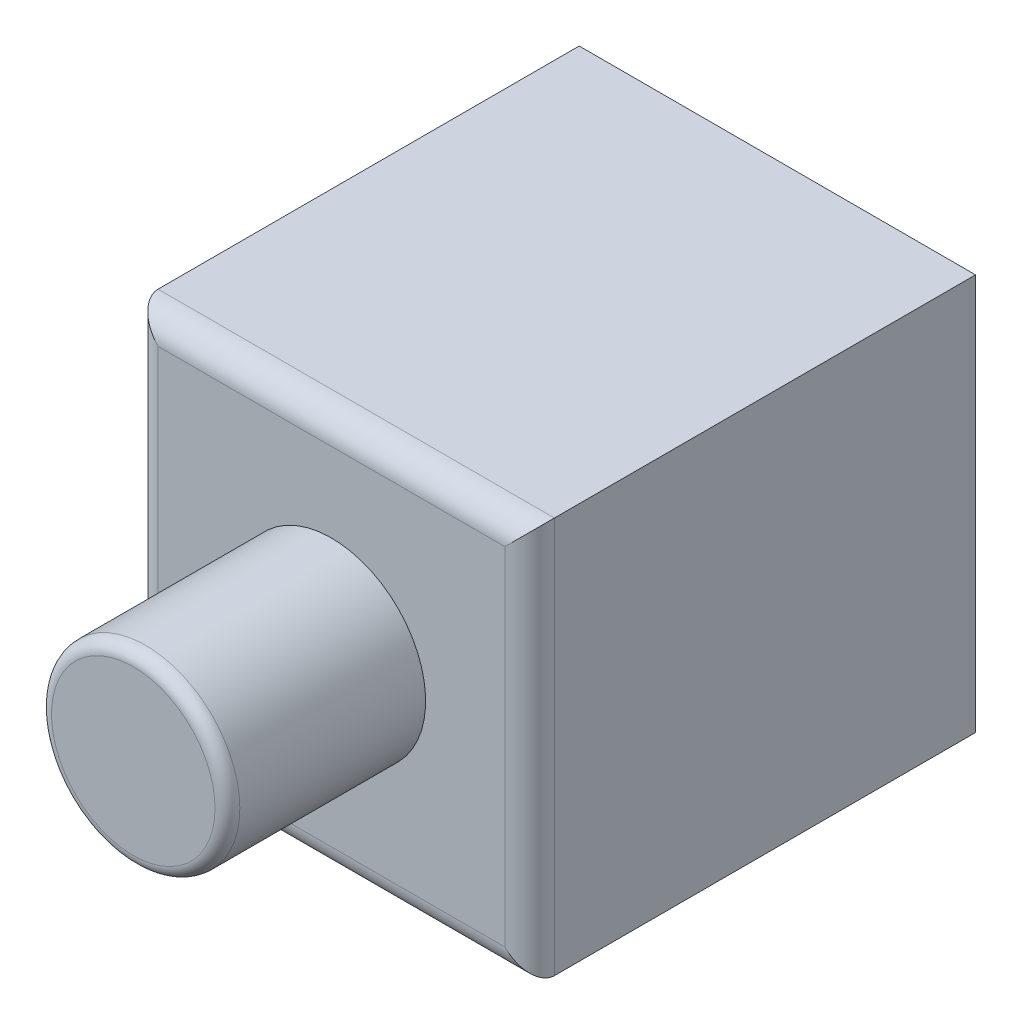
from build123d import *

# Parameters (mm, degrees)
SKETCH1_W      = 8
SKETCH1_H      = 8
EXTRUDE1_DEPTH = 9
SKETCH2_R      = 1.9
EXTRUDE2_DEPTH = 13
FILLET1_R      = 0.25
FILLET2_R      = 0.5


with BuildPart() as part:
    # Sketch1 → Extrude1 (new body)
    with BuildSketch(Plane.XY):
        Rectangle(SKETCH1_W, SKETCH1_H)
    extrude(amount=EXTRUDE1_DEPTH)

    # Sketch2 → Extrude2 (add)
    with BuildSketch(Plane.XY):
        with Locations(Location((0, 0, 0), (0, 0, 180))):
            Circle(SKETCH2_R)
    extrude(amount=EXTRUDE2_DEPTH)

    # Fillet1
    fillet1_edges = [part.edges().sort_by_distance(p)[0] for p in [
        (1.9, 0, 13),
    ]]
    fillet(fillet1_edges, radius=FILLET1_R)

    # Fillet2
    fillet2_edges = [part.edges().sort_by_distance(p)[0] for p in [
        (4, 0, 9),
        (0, 4, 9),
        (-4, 0, 9),
        (0, -4, 9),
    ]]
    fillet(fillet2_edges, radius=FILLET2_R)


solid = part.part
